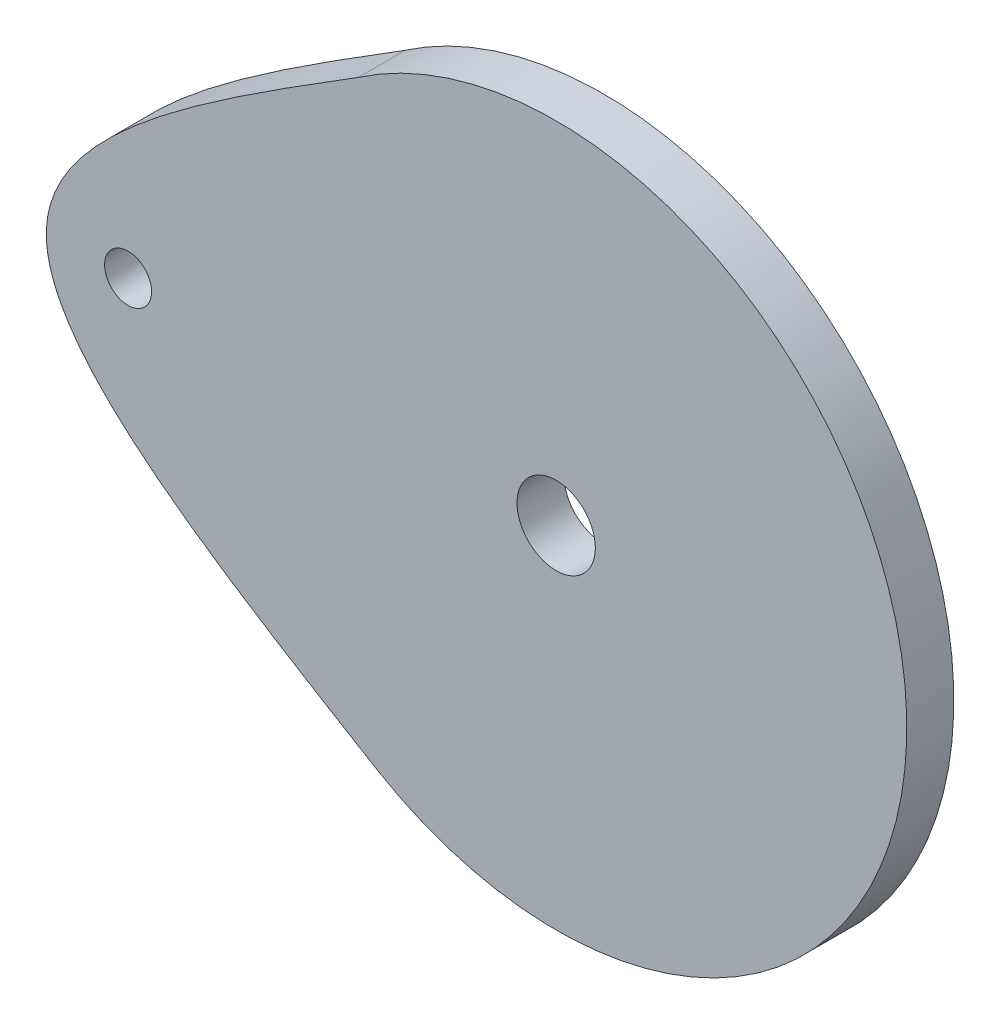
ISO-10303-21;
HEADER;
FILE_DESCRIPTION(('STEP AP214'),'2;1');
FILE_NAME('part.step','',(''),(''),'','','');
FILE_SCHEMA(('AUTOMOTIVE_DESIGN { 1 0 10303 214 1 1 1 1 }'));
ENDSEC;
DATA;
#1=APPLICATION_CONTEXT('core data for automotive mechanical design processes');
#2=APPLICATION_PROTOCOL_DEFINITION('international standard','automotive_design',2000,#1);
#3=PRODUCT_CONTEXT('',#1,'mechanical');
#4=PRODUCT('Part','Part','',(#3));
#5=PRODUCT_RELATED_PRODUCT_CATEGORY('part','',(#4));
#6=PRODUCT_DEFINITION_FORMATION('','',#4);
#7=PRODUCT_DEFINITION_CONTEXT('part definition',#1,'design');
#8=PRODUCT_DEFINITION('design','',#6,#7);
#9=PRODUCT_DEFINITION_SHAPE('','',#8);
#10=(LENGTH_UNIT() NAMED_UNIT(*) SI_UNIT(.MILLI.,.METRE.));
#11=(NAMED_UNIT(*) PLANE_ANGLE_UNIT() SI_UNIT($,.RADIAN.));
#12=(NAMED_UNIT(*) SI_UNIT($,.STERADIAN.) SOLID_ANGLE_UNIT());
#13=UNCERTAINTY_MEASURE_WITH_UNIT(LENGTH_MEASURE(1.E-05),#10,'distance_accuracy_value','');
#14=(GEOMETRIC_REPRESENTATION_CONTEXT(3) GLOBAL_UNCERTAINTY_ASSIGNED_CONTEXT((#13)) GLOBAL_UNIT_ASSIGNED_CONTEXT((#10,
#11,#12)) REPRESENTATION_CONTEXT('',''));
#15=CARTESIAN_POINT('',(0.,0.,0.));
#16=DIRECTION('',(0.,0.,1.));
#17=DIRECTION('',(1.,0.,0.));
#18=AXIS2_PLACEMENT_3D('',#15,#16,#17);
#19=CARTESIAN_POINT('',(-32.5290061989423,-0.540945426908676,3.));
#20=DIRECTION('',(0.,0.,-1.));
#21=DIRECTION('',(-1.,0.,0.));
#22=AXIS2_PLACEMENT_3D('',#19,#20,#21);
#23=PLANE('',#22);
#24=CARTESIAN_POINT('',(0.,0.,3.));
#25=DIRECTION('',(0.,0.,1.));
#26=DIRECTION('',(1.,0.,0.));
#27=AXIS2_PLACEMENT_3D('',#24,#25,#26);
#28=CIRCLE('',#27,2.5);
#29=CARTESIAN_POINT('',(2.5,0.,3.));
#30=VERTEX_POINT('',#29);
#31=EDGE_CURVE('E71',#30,#30,#28,.T.);
#32=ORIENTED_EDGE('',*,*,#31,.F.);
#33=EDGE_LOOP('',(#32));
#34=FACE_BOUND('',#33,.T.);
#35=CARTESIAN_POINT('',(-12.6294223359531,18.4508279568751,3.));
#36=CARTESIAN_POINT('',(-22.504946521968,12.2838956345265,3.));
#37=CARTESIAN_POINT('',(-42.8383529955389,-0.413632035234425,3.));
#38=CARTESIAN_POINT('',(-21.9821903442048,-12.8993232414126,3.));
#39=CARTESIAN_POINT('',(-11.2554439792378,-19.3209668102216,3.));
#40=B_SPLINE_CURVE_WITH_KNOTS('',3,(#35,#36,#37,#38,#39),.UNSPECIFIED.,.F.,.F.,(4,1,4),(0.,
0.4856797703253,1.),.UNSPECIFIED.);
#41=CARTESIAN_POINT('',(-12.6294223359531,18.4508279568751,3.));
#42=VERTEX_POINT('',#41);
#43=CARTESIAN_POINT('',(-11.2554439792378,-19.3209668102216,3.));
#44=VERTEX_POINT('',#43);
#45=EDGE_CURVE('E65',#42,#44,#40,.T.);
#46=ORIENTED_EDGE('',*,*,#45,.T.);
#47=CARTESIAN_POINT('',(0.0125059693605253,-0.000199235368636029,3.));
#48=DIRECTION('',(0.,0.,1.));
#49=DIRECTION('',(1.,0.,0.));
#50=AXIS2_PLACEMENT_3D('',#47,#48,#49);
#51=CIRCLE('',#50,22.3664649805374);
#52=EDGE_CURVE('E50',#44,#42,#51,.T.);
#53=ORIENTED_EDGE('',*,*,#52,.T.);
#54=EDGE_LOOP('',(#46,#53));
#55=FACE_BOUND('',#54,.T.);
#56=CARTESIAN_POINT('',(-27.32,0.,3.));
#57=DIRECTION('',(0.,0.,1.));
#58=DIRECTION('',(1.,0.,0.));
#59=AXIS2_PLACEMENT_3D('',#56,#57,#58);
#60=CIRCLE('',#59,1.5);
#61=CARTESIAN_POINT('',(-25.82,0.,3.));
#62=VERTEX_POINT('',#61);
#63=EDGE_CURVE('E90',#62,#62,#60,.T.);
#64=ORIENTED_EDGE('',*,*,#63,.F.);
#65=EDGE_LOOP('',(#64));
#66=FACE_BOUND('',#65,.T.);
#67=ADVANCED_FACE('F33',(#34,#55,#66),#23,.F.);
#68=CARTESIAN_POINT('',(-32.5290061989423,-0.540945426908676,0.));
#69=DIRECTION('',(0.,0.,-1.));
#70=DIRECTION('',(-1.,0.,0.));
#71=AXIS2_PLACEMENT_3D('',#68,#69,#70);
#72=PLANE('',#71);
#73=CARTESIAN_POINT('',(0.,0.,0.));
#74=DIRECTION('',(0.,0.,1.));
#75=DIRECTION('',(1.,0.,0.));
#76=AXIS2_PLACEMENT_3D('',#73,#74,#75);
#77=CIRCLE('',#76,2.5);
#78=CARTESIAN_POINT('',(2.5,0.,0.));
#79=VERTEX_POINT('',#78);
#80=EDGE_CURVE('E74',#79,#79,#77,.T.);
#81=ORIENTED_EDGE('',*,*,#80,.T.);
#82=EDGE_LOOP('',(#81));
#83=FACE_BOUND('',#82,.T.);
#84=CARTESIAN_POINT('',(-12.6294223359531,18.4508279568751,0.));
#85=CARTESIAN_POINT('',(-22.504946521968,12.2838956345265,0.));
#86=CARTESIAN_POINT('',(-42.8383529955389,-0.413632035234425,0.));
#87=CARTESIAN_POINT('',(-21.9821903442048,-12.8993232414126,0.));
#88=CARTESIAN_POINT('',(-11.2554439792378,-19.3209668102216,0.));
#89=B_SPLINE_CURVE_WITH_KNOTS('',3,(#84,#85,#86,#87,#88),.UNSPECIFIED.,.F.,.F.,(4,1,4),(0.,
0.4856797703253,1.),.UNSPECIFIED.);
#90=CARTESIAN_POINT('',(-12.6294223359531,18.4508279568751,0.));
#91=VERTEX_POINT('',#90);
#92=CARTESIAN_POINT('',(-11.2554439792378,-19.3209668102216,0.));
#93=VERTEX_POINT('',#92);
#94=EDGE_CURVE('E66',#91,#93,#89,.T.);
#95=ORIENTED_EDGE('',*,*,#94,.F.);
#96=CARTESIAN_POINT('',(0.0125059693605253,-0.000199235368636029,0.));
#97=DIRECTION('',(0.,0.,1.));
#98=DIRECTION('',(1.,0.,0.));
#99=AXIS2_PLACEMENT_3D('',#96,#97,#98);
#100=CIRCLE('',#99,22.3664649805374);
#101=EDGE_CURVE('E58',#93,#91,#100,.T.);
#102=ORIENTED_EDGE('',*,*,#101,.F.);
#103=EDGE_LOOP('',(#95,#102));
#104=FACE_BOUND('',#103,.T.);
#105=CARTESIAN_POINT('',(-27.32,0.,0.));
#106=DIRECTION('',(0.,0.,1.));
#107=DIRECTION('',(1.,0.,0.));
#108=AXIS2_PLACEMENT_3D('',#105,#106,#107);
#109=CIRCLE('',#108,1.5);
#110=CARTESIAN_POINT('',(-25.82,0.,0.));
#111=VERTEX_POINT('',#110);
#112=EDGE_CURVE('E92',#111,#111,#109,.T.);
#113=ORIENTED_EDGE('',*,*,#112,.T.);
#114=EDGE_LOOP('',(#113));
#115=FACE_BOUND('',#114,.T.);
#116=ADVANCED_FACE('F69',(#83,#104,#115),#72,.T.);
#117=DIRECTION('',(0.,0.,-1.));
#118=VECTOR('',#117,1.);
#119=SURFACE_OF_LINEAR_EXTRUSION('',#40,#118);
#120=ORIENTED_EDGE('',*,*,#94,.T.);
#121=DIRECTION('',(0.,0.,-1.));
#122=VECTOR('',#121,1.);
#123=CARTESIAN_POINT('',(-11.2554439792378,-19.3209668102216,3.));
#124=LINE('',#123,#122);
#125=EDGE_CURVE('E11',#44,#93,#124,.T.);
#126=ORIENTED_EDGE('',*,*,#125,.F.);
#127=ORIENTED_EDGE('',*,*,#45,.F.);
#128=DIRECTION('',(0.,0.,-1.));
#129=VECTOR('',#128,1.);
#130=CARTESIAN_POINT('',(-12.6294223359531,18.4508279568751,3.));
#131=LINE('',#130,#129);
#132=EDGE_CURVE('E43',#42,#91,#131,.T.);
#133=ORIENTED_EDGE('',*,*,#132,.T.);
#134=EDGE_LOOP('',(#120,#126,#127,#133));
#135=FACE_BOUND('',#134,.T.);
#136=ADVANCED_FACE('F35',(#135),#119,.F.);
#137=CARTESIAN_POINT('',(0.0125059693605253,-0.000199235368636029,3.));
#138=DIRECTION('',(0.,0.,-1.));
#139=DIRECTION('',(-1.,0.,0.));
#140=AXIS2_PLACEMENT_3D('',#137,#138,#139);
#141=CYLINDRICAL_SURFACE('',#140,22.3664649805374);
#142=ORIENTED_EDGE('',*,*,#101,.T.);
#143=ORIENTED_EDGE('',*,*,#132,.F.);
#144=ORIENTED_EDGE('',*,*,#52,.F.);
#145=ORIENTED_EDGE('',*,*,#125,.T.);
#146=EDGE_LOOP('',(#142,#143,#144,#145));
#147=FACE_BOUND('',#146,.T.);
#148=ADVANCED_FACE('F61',(#147),#141,.T.);
#149=CARTESIAN_POINT('',(0.,0.,3.));
#150=DIRECTION('',(0.,0.,-1.));
#151=DIRECTION('',(-1.,0.,0.));
#152=AXIS2_PLACEMENT_3D('',#149,#150,#151);
#153=CYLINDRICAL_SURFACE('',#152,2.5);
#154=ORIENTED_EDGE('',*,*,#31,.T.);
#155=EDGE_LOOP('',(#154));
#156=FACE_BOUND('',#155,.T.);
#157=ORIENTED_EDGE('',*,*,#80,.F.);
#158=EDGE_LOOP('',(#157));
#159=FACE_BOUND('',#158,.T.);
#160=ADVANCED_FACE('F111',(#156,#159),#153,.F.);
#161=CARTESIAN_POINT('',(-27.32,0.,3.));
#162=DIRECTION('',(0.,0.,-1.));
#163=DIRECTION('',(-1.,0.,0.));
#164=AXIS2_PLACEMENT_3D('',#161,#162,#163);
#165=CYLINDRICAL_SURFACE('',#164,1.5);
#166=ORIENTED_EDGE('',*,*,#63,.T.);
#167=EDGE_LOOP('',(#166));
#168=FACE_BOUND('',#167,.T.);
#169=ORIENTED_EDGE('',*,*,#112,.F.);
#170=EDGE_LOOP('',(#169));
#171=FACE_BOUND('',#170,.T.);
#172=ADVANCED_FACE('F98',(#168,#171),#165,.F.);
#173=CLOSED_SHELL('',(#67,#116,#136,#148,#160,#172));
#174=MANIFOLD_SOLID_BREP('B2',#173);
#175=ADVANCED_BREP_SHAPE_REPRESENTATION('',(#18,#174),#14);
#176=SHAPE_DEFINITION_REPRESENTATION(#9,#175);
ENDSEC;
END-ISO-10303-21;
